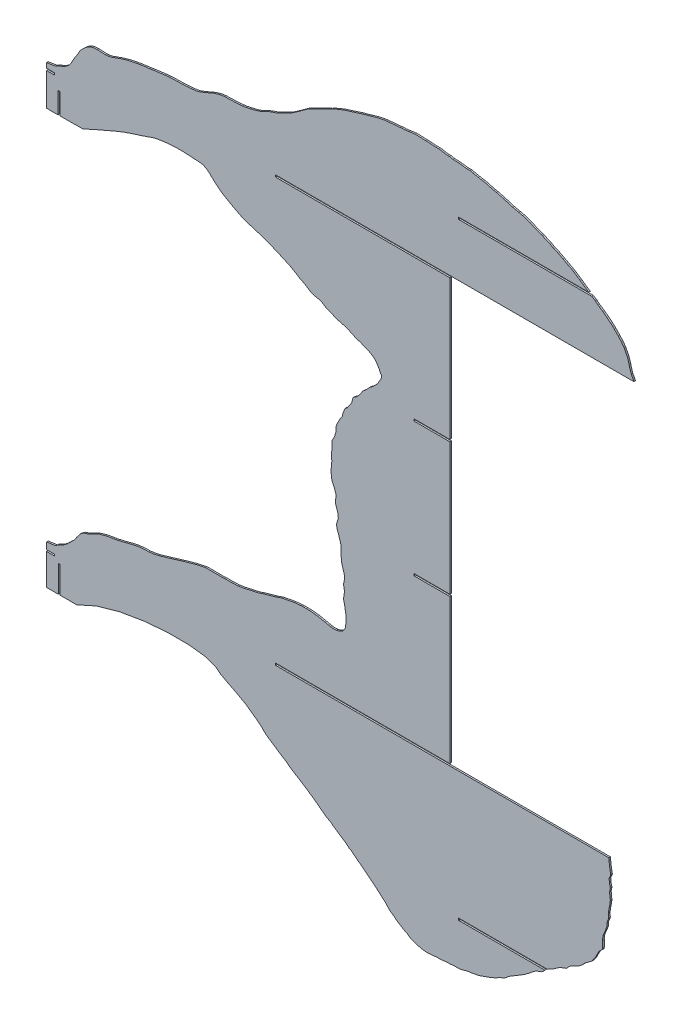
from build123d import *

# Parameters (mm, degrees)
EXTRUDE_1_DEPTH = 2


with BuildPart() as part:
    # Model → Extrude 1 (new body)
    with BuildSketch(Plane.XY):
        Polygon((-3659.4088, 337.2623), (-3649.3155, 337.2623), (-3649.3155, 339.2623), (-3659.4088, 339.2623), (-3659.4088, 347.0727), (-3659.15, 347.5463), (-3647.8631, 349.1225), (-3646.4682, 350.2928), (-3646.1801, 350.5755), (-3644.035, 351.8111), (-3640.8509, 353.3027), (-3638.1073, 355.0172), (-3637.5726, 355.2726), (-3637.2801, 355.5406), (-3635.3742, 356.9104), (-3635.3505, 356.9504), (-3632.9974, 358.7257), (-3631.9578, 360.0561), (-3630.5631, 361.0845), (-3629.7103, 361.911), (-3629.6644, 362.1925), (-3625.4574, 366.0569), (-3625.409, 366.1805), (-3622.3043, 370.4676), (-3621.7645, 371.2607), (-3621.5765, 371.5394), (-3621.3887, 371.8182), (-3621.0192, 372.2063), (-3617.6821, 376.6565), (-3615.281, 378.6078), (-3613.1208, 380.0967), (-3608.8328, 381.5595), (-3604.8656, 383.1913), (-3602.0015, 384.5371), (-3597.7094, 386.8426), (-3595.8936, 387.7443), (-3592.8574, 389.0094), (-3585.2364, 391.0565), (-3585.1795, 391.0721), (-3585.1226, 391.0877), (-3584.9168, 391.1142), (-3577.4862, 392.5355), (-3575.5445, 392.7956), (-3573.322, 393.1171), (-3570.3986, 393.6991), (-3568.5413, 394.2156), (-3561.6069, 395.7715), (-3560.2819, 396.0994), (-3559.4776, 396.3291), (-3551.2263, 398.491), (-3550.5538, 398.6438), (-3547.3795, 399.2746), (-3546.0565, 399.5196), (-3543.9064, 399.7692), (-3539.775, 400.2472), (-3531.8396, 400.5535), (-3527.8975, 400.968), (-3525.4073, 401.3409), (-3520.2647, 402.5635), (-3518.7104, 402.8664), (-3517.6553, 403.1274), (-3511.9556, 404.8469), (-3506.9614, 406.2412), (-3498.2225, 408.9567), (-3496.8997, 409.4214), (-3491.8927, 410.8884), (-3491.0672, 411.0675), (-3488.8385, 411.8241), (-3483.442, 413.3824), (-3478.422, 414.7273), (-3472.647, 416.3851), (-3471.3883, 416.6549), (-3461.5572, 418.7129), (-3461.0606, 418.8202), (-3460.6243, 418.8555), (-3452.8575, 418.8324), (-3445.1597, 418.7839), (-3441.9923, 418.7149), (-3439.0233, 418.7909), (-3437.056, 418.9925), (-3431.6905, 418.9816), (-3429.2882, 418.8589), (-3427.9578, 418.9259), (-3424.1756, 419.1709), (-3421.4486, 419.2988), (-3420.5516, 419.3881), (-3419.4176, 419.5984), (-3413.984, 420.3053), (-3408.2791, 421.6846), (-3408.253, 421.69), (-3408.2269, 421.6954), (-3408.1771, 421.7132), (-3408.13, 421.7249), (-3403.4, 422.847), (-3401.0462, 423.1767), (-3398.1966, 423.8763), (-3394.6744, 424.7099), (-3390.1671, 426.2731), (-3389.9757, 426.3233), (-3389.7843, 426.3735), (-3389.6265, 426.4156), (-3389.4688, 426.4576), (-3382.1798, 428.6192), (-3380.5787, 429.0409), (-3374.8822, 430.6557), (-3371.9735, 431.5056), (-3369.5433, 432.4494), (-3366.4566, 433.4155), (-3364.357, 433.9945), (-3360.9254, 434.5253), (-3352.9075, 436.1205), (-3350.255, 436.5114), (-3344.5418, 437.0877), (-3341.8287, 437.3396), (-3340.596, 437.3971), (-3335.0216, 437.4364), (-3330.9464, 437.28), (-3326.0731, 436.8271), (-3321.4552, 436.3248), (-3312.8116, 434.5679), (-3308.004, 433.5045), (-3305.5709, 432.9001), (-3304.4671, 432.9049), (-3302.5904, 432.6146), (-3298.4105, 432.7226), (-3298.3045, 432.7126), (-3298.1986, 432.7124), (-3295.7388, 433.4062), (-3295.0428, 433.5812), (-3293.192, 434.3278), (-3290.2706, 436.0132), (-3290.0604, 436.2078), (-3289.981, 436.3371), (-3289.9019, 436.4664), (-3288.0821, 438.7803), (-3287.0845, 440.5862), (-3286.7364, 442.4386), (-3286.4866, 445.0603), (-3286.3692, 445.7683), (-3286.2518, 446.4763), (-3286.1373, 446.9131), (-3286.1268, 447.0846), (-3286.1165, 447.2561), (-3286.0177, 448.2623), (-3285.8695, 449.9895), (-3285.8734, 450.7023), (-3285.8775, 451.415), (-3286.4085, 456.209), (-3286.5682, 457.0887), (-3286.7279, 457.9685), (-3287.5396, 463.1307), (-3287.6644, 463.8354), (-3289.1263, 470.3016), (-3289.1683, 471.0357), (-3289.2103, 471.7697), (-3289.211, 471.8312), (-3289.1859, 471.8983), (-3289.1607, 471.9655), (-3288.2274, 478.2117), (-3288.3211, 481.2084), (-3289.1314, 486.151), (-3289.0694, 486.6238), (-3289.0074, 487.0965), (-3288.9803, 488.2449), (-3288.9534, 489.3932), (-3288.377, 490.986), (-3288.2838, 491.6988), (-3288.2847, 492.9639), (-3287.9085, 495.7334), (-3288.4552, 498.5319), (-3289.7574, 502.7495), (-3290.0123, 503.6582), (-3290.2672, 504.567), (-3290.6309, 505.4973), (-3290.9947, 506.4277), (-3291.5194, 509.0262), (-3291.9017, 512.7728), (-3292.0426, 513.9631), (-3292.1837, 515.1535), (-3292.3988, 521.6939), (-3292.3992, 525.126), (-3292.7205, 528.4976), (-3292.868, 529.2128), (-3293.0155, 529.928), (-3293.8077, 532.2159), (-3294.9315, 535.9393), (-3295.3668, 537.6521), (-3297.4005, 542.8596), (-3297.8387, 545.6981), (-3297.9193, 546.8756), (-3297.2691, 550.3362), (-3296.1248, 553.7305), (-3295.9139, 554.3348), (-3295.703, 554.9392), (-3296.2838, 559.1301), (-3296.2635, 560.0077), (-3296.293, 560.2726), (-3299.1519, 568.9351), (-3299.2755, 569.3047), (-3299.2767, 569.3159), (-3299.2782, 569.3272), (-3299.2747, 569.3801), (-3299.2713, 569.433), (-3299.1732, 574.0535), (-3299.0118, 574.3897), (-3298.8504, 574.7258), (-3298.4647, 578.0221), (-3298.4412, 578.593), (-3299.8748, 582.7346), (-3299.9605, 583.1378), (-3300.0465, 583.541), (-3303.6085, 591.5479), (-3303.8116, 592.3677), (-3304.015, 593.1875), (-3304.2962, 594.9847), (-3304.7821, 601.4762), (-3304.6607, 603.6652), (-3304.1312, 608.1517), (-3303.8829, 612.1683), (-3303.9595, 614.127), (-3304.1243, 616.8857), (-3303.9539, 618.0922), (-3303.9539, 618.4237), (-3303.9539, 618.7551), (-3303.9288, 623.5233), (-3303.4842, 626.4954), (-3303.9464, 630.7457), (-3303.8768, 631.8074), (-3303.868, 632.5643), (-3303.8592, 633.3213), (-3303.5899, 634.428), (-3303.3209, 635.5347), (-3301.1346, 639.1162), (-3300.7923, 639.759), (-3300.4503, 640.4017), (-3300.1502, 641.4346), (-3299.8658, 642.6189), (-3298.7037, 646.5537), (-3298.8087, 648.1917), (-3298.7528, 651.0909), (-3298.1815, 654.047), (-3297.7955, 654.6354), (-3297.4095, 655.2239), (-3297.0513, 656.4668), (-3295.2716, 659.7721), (-3294.9403, 660.5859), (-3293.9227, 662.4513), (-3293.449, 663.5491), (-3291.3519, 666.3707), (-3290.6597, 667.2816), (-3290.566, 667.9143), (-3290.0118, 671.2581), (-3288.2508, 675.3898), (-3287.9769, 676.1389), (-3287.703, 676.8879), (-3287.596, 677.1597), (-3287.4891, 677.4314), (-3285.8311, 678.5922), (-3284.6109, 679.4458), (-3283.7684, 680.897), (-3282.9823, 682.2129), (-3282.0411, 683.3925), (-3280.0972, 686.2822), (-3279.3026, 687.7454), (-3278.6788, 689.0056), (-3278.2823, 691.4264), (-3278.0636, 692.3671), (-3277.2506, 694.4464), (-3276.8765, 694.7518), (-3276.5028, 695.0573), (-3273.807, 696.7064), (-3272.2908, 698.0122), (-3269.5076, 701.1151), (-3269.168, 701.4777), (-3268.8287, 701.8403), (-3267.7982, 703.2976), (-3265.567, 706.9701), (-3264.3548, 708.0449), (-3261.1759, 710.6555), (-3258.0545, 714.1406), (-3257.8165, 714.4504), (-3257.5787, 714.7603), (-3257.3382, 714.9592), (-3257.098, 715.1581), (-3256.7957, 715.4345), (-3256.4937, 715.7108), (-3252.5233, 718.6021), (-3248.8912, 722.4143), (-3247.3201, 723.8026), (-3245.9958, 725.8405), (-3245.2092, 727.6705), (-3243.5615, 730.1585), (-3243.134, 730.8071), (-3242.7065, 731.4558), (-3242.0099, 733.3641), (-3241.9269, 733.6895), (-3241.8515, 734.2061), (-3241.7763, 734.7227), (-3241.8591, 734.9879), (-3241.9206, 735.3684), (-3241.8547, 735.8762), (-3242.0375, 736.2616), (-3242.5737, 736.7289), (-3244.0129, 738.9802), (-3244.1408, 739.5122), (-3244.269, 740.0442), (-3244.6142, 740.8704), (-3244.9594, 741.6967), (-3245.9213, 743.0676), (-3245.9438, 743.2604), (-3245.9662, 743.4531), (-3247.2288, 745.085), (-3247.4561, 745.5867), (-3247.6837, 746.0885), (-3249.544, 748.7163), (-3253.4732, 751.6041), (-3253.4757, 751.606), (-3253.4835, 751.6101), (-3257.6417, 754.1653), (-3262.1629, 755.7285), (-3262.3995, 755.7892), (-3262.6361, 755.8499), (-3263.9842, 756.4589), (-3265.1583, 757.1176), (-3265.3277, 757.1771), (-3265.4971, 757.2367), (-3267.7598, 758.3345), (-3267.8023, 758.3399), (-3267.8448, 758.3452), (-3267.9554, 758.3641), (-3268.0662, 758.3831), (-3270.1812, 759.0607), (-3273.4439, 759.9802), (-3273.6295, 760.0104), (-3278.2227, 762.4507), (-3280.8057, 763.4719), (-3281.1295, 763.6698), (-3281.3311, 763.739), (-3281.4625, 763.7821), (-3281.5938, 763.8252), (-3283.2899, 764.5444), (-3286.849, 766.1364), (-3287.5362, 766.2044), (-3288.2559, 766.3848), (-3291.9708, 767.3807), (-3295.4251, 768.2042), (-3296.5272, 768.5413), (-3300.2991, 769.955), (-3302.3817, 770.8872), (-3305.3765, 772.4581), (-3310.0709, 773.8463), (-3310.1431, 773.8709), (-3314.9315, 777.0049), (-3315.1859, 777.1483), (-3315.4403, 777.2916), (-3317.6864, 778.3079), (-3320.7918, 779.2971), (-3320.8267, 779.312), (-3320.8619, 779.3269), (-3320.8863, 779.3302), (-3320.9107, 779.3335), (-3324.909, 780.0305), (-3325.6712, 780.1598), (-3328.4002, 780.927), (-3329.2103, 781.4102), (-3331.5672, 782.679), (-3334.608, 784.7333), (-3336.3646, 785.9934), (-3338.3443, 787.0547), (-3344.4989, 790.1213), (-3348.366, 792.7183), (-3352.0919, 794.8547), (-3357.2703, 797.7913), (-3363.6226, 800.3911), (-3363.7108, 800.4222), (-3370.304, 803.5359), (-3370.6639, 803.6913), (-3370.9935, 803.8199), (-3371.3231, 803.9485), (-3381.347, 808.0862), (-3383.9945, 809.0479), (-3390.9222, 811.6316), (-3398.2713, 813.9082), (-3407.9417, 816.9002), (-3414.3045, 819.1515), (-3415.0643, 819.4529), (-3415.512, 819.652), (-3416.5509, 820.1542), (-3423.0863, 823.4036), (-3429.8287, 827.0191), (-3434.5516, 829.7068), (-3438.0753, 831.8914), (-3443.1605, 835.229), (-3443.8228, 835.7111), (-3448.0802, 839.1972), (-3454.4495, 845.062), (-3457.4896, 847.9663), (-3460.776, 850.2266), (-3461.0572, 850.4297), (-3461.1978, 850.4887), (-3461.3385, 850.5477), (-3462.8902, 851.1951), (-3464.6693, 851.9994), (-3464.7684, 852.0405), (-3464.8678, 852.0816), (-3466.9093, 852.3552), (-3468.0477, 852.5371), (-3468.1446, 852.5561), (-3468.2418, 852.5751), (-3469.6773, 852.6567), (-3489.7198, 853.8401), (-3492.774, 853.7993), (-3497.9481, 853.8388), (-3500.9335, 853.6661), (-3505.2528, 853.3816), (-3513.0054, 852.5294), (-3514.4254, 852.4082), (-3516.0228, 852.1261), (-3521.453, 851.2953), (-3525.514, 850.2896), (-3528.2471, 849.4955), (-3533.7718, 847.5649), (-3541.2449, 845.0394), (-3552.2575, 841.4723), (-3553.265, 841.1592), (-3554.1062, 840.8693), (-3562.8416, 837.9146), (-3564.9625, 837.0508), (-3574.9366, 833.1111), (-3585.1458, 828.5784), (-3585.6634, 828.3682), (-3586.254, 828.1343), (-3599.0191, 822.6442), (-3601.8382, 821.5305), (-3608.5824, 818.2112), (-3610.5816, 817.349), (-3614.3665, 815.8294), (-3642.4041, 815.5363), (-3642.4041, 841.861), (-3642.6541, 841.861), (-3644.6541, 841.861), (-3644.9041, 841.861), (-3644.9041, 815.5121), (-3659.3858, 815.4688), (-3659.3858, 856.2086), (-3649.316, 856.2086), (-3649.316, 856.4586), (-3649.316, 858.4586), (-3649.316, 858.7086), (-3659.3858, 858.7086), (-3659.3858, 864.7969), (-3647.9893, 866.4534), (-3647.8953, 866.593), (-3647.6441, 866.8042), (-3645.7834, 868.0435), (-3644.0457, 868.8997), (-3640.8592, 870.0783), (-3638.7601, 870.9019), (-3636.629, 872.0472), (-3634.2489, 873.5946), (-3631.9635, 875.3132), (-3631.1352, 876.1233), (-3629.5645, 878.2477), (-3628.9544, 878.8694), (-3626.8436, 883.0201), (-3624.7706, 886.6925), (-3621.5199, 891.5044), (-3620.9991, 892.5305), (-3617.6552, 898.2273), (-3616.7344, 899.4209), (-3614.7832, 901.4733), (-3611.5046, 904.5562), (-3608.7801, 906.7772), (-3607.237, 907.6827), (-3605.7431, 908.3713), (-3604.0188, 909.3092), (-3601.7493, 909.9563), (-3600.7467, 910.1682), (-3596.7349, 910.4182), (-3596.1116, 910.4482), (-3594.8358, 910.4113), (-3586.4615, 909.9118), (-3584.7601, 910.0518), (-3583.7032, 910.0595), (-3581.951, 910.3115), (-3578.7935, 910.9379), (-3575.3807, 912.1852), (-3572.1094, 913.3336), (-3565.0184, 915.7952), (-3558.1956, 917.7784), (-3555.8431, 918.3431), (-3548.345, 919.8879), (-3545.3575, 920.4164), (-3542.3709, 920.8733), (-3534.6871, 922.0118), (-3530.795, 922.4594), (-3526.5269, 923.1776), (-3512.223, 925.0082), (-3511.2288, 925.1937), (-3508.8919, 925.4513), (-3507.5035, 925.5681), (-3506.0799, 925.6306), (-3496.6702, 926.0156), (-3489.9332, 926.0608), (-3483.2576, 926.4611), (-3479.4324, 926.6715), (-3478.7796, 926.7676), (-3470.3089, 927.9437), (-3462.6541, 930.9243), (-3460.3426, 931.8104), (-3458.4007, 932.6805), (-3450.8297, 935.9166), (-3446.2745, 937.3384), (-3442.9949, 938.2039), (-3439.15, 938.7933), (-3436.6998, 939.0336), (-3424.8426, 939.4286), (-3421.5628, 939.4724), (-3418.7498, 939.7201), (-3415.4578, 940.0453), (-3414.2074, 940.3191), (-3411.1317, 940.6419), (-3409.4183, 941.1027), (-3405.9991, 941.702), (-3404.055, 942.2954), (-3401.0689, 942.9113), (-3397.1671, 943.9469), (-3394.4056, 944.8274), (-3393.0582, 945.3064), (-3390.7615, 946.2192), (-3385.4364, 949.0115), (-3383.3939, 950.0313), (-3379.6944, 951.3529), (-3375.3841, 952.932), (-3372.5213, 953.7422), (-3370.5145, 954.6492), (-3367.0245, 956.4463), (-3364.1844, 958.1299), (-3355.1561, 962.6889), (-3353.139, 963.6598), (-3352.1844, 964.2932), (-3343.7652, 970.105), (-3341.6449, 971.738), (-3334.7989, 976.7271), (-3334.5391, 976.8698), (-3334.2796, 977.0125), (-3328.3748, 980.0772), (-3327.4505, 980.5332), (-3323.515, 982.5596), (-3318.4722, 985.2311), (-3312.949, 987.8814), (-3305.0194, 991.6101), (-3302.326, 993.0651), (-3299.047, 994.6173), (-3295.616, 996.1498), (-3289.6229, 998.4661), (-3286.3619, 999.6426), (-3280.9024, 1001.2554), (-3266.3443, 1005.9871), (-3265.1715, 1006.3008), (-3262.743, 1006.8989), (-3254.418, 1009.2996), (-3246.4511, 1011.6083), (-3239.1218, 1013.0641), (-3235.5695, 1013.637), (-3233.4084, 1013.7434), (-3226.0168, 1014.4719), (-3222.0986, 1014.5996), (-3218.6115, 1015.0579), (-3217.0922, 1015.3057), (-3212.8058, 1015.464), (-3208.892, 1015.8962), (-3207.0861, 1016.2246), (-3199.965, 1017.2197), (-3199.7851, 1017.2374), (-3187.143, 1016.7146), (-3187.039, 1016.7155), (-3186.8722, 1016.7124), (-3186.6366, 1016.721), (-3186.4977, 1016.7236), (-3186.1857, 1016.7395), (-3181.6213, 1016.6107), (-3176.5253, 1016.1841), (-3174.4755, 1016.0643), (-3170.4511, 1015.9727), (-3167.4169, 1015.7316), (-3164.1752, 1015.0105), (-3159.4797, 1014.3843), (-3157.2184, 1014.4535), (-3153.0842, 1013.5867), (-3152.4308, 1013.4922), (-3152.007, 1013.4844), (-3146.0573, 1013.3621), (-3143.1623, 1012.9193), (-3135.2804, 1012.0338), (-3131.7272, 1012.0886), (-3130.4721, 1011.8825), (-3128.1699, 1011.2957), (-3121.5251, 1009.9906), (-3116.5737, 1009.0452), (-3114.7575, 1008.8447), (-3110.3439, 1007.8218), (-3105.7905, 1006.4678), (-3103.6911, 1005.9749), (-3101.7072, 1005.438), (-3099.2241, 1005.0532), (-3097.79, 1004.7625), (-3090.5932, 1002.7439), (-3089.8595, 1002.4749), (-3087.7223, 1001.8516), (-3084.2983, 1000.9777), (-3079.1979, 999.2354), (-3079.0932, 999.2075), (-3078.9887, 999.1796), (-3072.1176, 997.6453), (-3071.2631, 997.4701), (-3070.4152, 997.33), (-3065.9118, 996.1691), (-3062.2502, 994.9215), (-3056.8659, 993.0621), (-3050.217, 990.2177), (-3043.081, 987.3744), (-3042.2514, 987.0974), (-3042.1471, 987.0596), (-3042.0431, 987.0219), (-3041.0881, 986.6451), (-3040.7568, 986.4705), (-3032.4577, 983.0962), (-3028.5424, 980.6213), (-3028.1083, 980.4074), (-3027.0556, 979.918), (-3021.9523, 977.8827), (-3020.6923, 977.3246), (-3015.8303, 974.6774), (-3011.3066, 972.1929), (-3008.923, 970.9335), (-3004.2665, 968.5678), (-3001.83, 967.1127), (-2997.6825, 964.2315), (-2994.9662, 962.5305), (-2993.8488, 961.7048), (-2990.8005, 959.5125), (-2987.5549, 957.272), (-2983.6554, 954.7347), (-3145.8259, 954.7347), (-3145.8259, 954.4847), (-3145.8259, 952.4847), (-3145.8259, 952.2347), (-2979.8132, 952.2347), (-2976.1357, 949.8417), (-2975.9135, 949.839), (-2975.1437, 949.1253), (-2972.0876, 946.6941), (-2970.3879, 945.4772), (-2965.9321, 942.5773), (-2961.0138, 938.7025), (-2956.2192, 934.9081), (-2953.7184, 932.684), (-2951.7961, 930.8381), (-2947.082, 925.9453), (-2943.0876, 921.5538), (-2939.9638, 917.2482), (-2939.7726, 916.9605), (-2939.5815, 916.6729), (-2939.5114, 916.578), (-2939.4413, 916.4832), (-2939.3244, 916.2833), (-2935.5815, 908.8784), (-2933.443, 902.1873), (-2932.9658, 899.6112), (-2930.7573, 892.8222), (-2930.7099, 892.6954), (-2930.6628, 892.5687), (-2930.5705, 892.3879), (-2930.4296, 892.1415), (-2928.8803, 889.5667), (-2927.4014, 886.3446), (-3373.7833, 886.3446), (-3373.7833, 886.0946), (-3373.7833, 884.0946), (-3373.7833, 883.8446), (-3156.8957, 883.8446), (-3156.8959, 709.7752), (-3156.8958, 709.3446), (-3201.3417, 709.3446), (-3201.3417, 709.0946), (-3201.3417, 707.0946), (-3201.3417, 706.8446), (-3156.8957, 706.8446), (-3156.8959, 542.3446), (-3201.3417, 542.3446), (-3201.3417, 542.0946), (-3201.3417, 540.0946), (-3201.3417, 539.8446), (-3156.8959, 539.8446), (-3156.8959, 359.5244), (-3373.7833, 359.5244), (-3373.7833, 359.2744), (-3373.7833, 357.2744), (-3373.7833, 357.0244), (-2958.6672, 357.0244), (-2958.3149, 354.7516), (-2958.3232, 353.9806), (-2958.3317, 353.2096), (-2957.8796, 349.3527), (-2957.2075, 344.7798), (-2956.3559, 340.6346), (-2956.3134, 339.323), (-2956.8327, 337.8619), (-2958.2021, 335.3839), (-2958.3251, 335.1666), (-2958.0527, 331.6184), (-2958.0966, 330.7587), (-2957.2011, 327.017), (-2956.7939, 325.1415), (-2957.7475, 320.8556), (-2957.7663, 320.7497), (-2957.766, 320.7263), (-2957.7658, 320.7029), (-2957.7575, 320.5815), (-2957.235, 314.8627), (-2956.7741, 311.8534), (-2956.8757, 311.2131), (-2956.9772, 310.5728), (-2957.2477, 308.1546), (-2957.3705, 307.3997), (-2957.4933, 306.6448), (-2958.0566, 304.2709), (-2959.089, 298.084), (-2959.1899, 297.6251), (-2959.2907, 297.1662), (-2959.2643, 296.9473), (-2959.2382, 296.7283), (-2958.7841, 291.6689), (-2959.4282, 289.9817), (-2960.8744, 286.2074), (-2960.9382, 285.1833), (-2960.9501, 282.7106), (-2961.2389, 281.0414), (-2962.1281, 278.7824), (-2962.426, 277.6918), (-2965.9311, 269.3624), (-2965.9699, 269.2189), (-2966.0087, 269.0754), (-2966.3993, 265.3298), (-2966.3383, 264.4336), (-2966.2773, 263.5375), (-2966.3241, 255.2684), (-2966.8386, 253.808), (-2970.4057, 250.3617), (-2970.4919, 250.2846), (-2970.5783, 250.2074), (-2970.601, 250.182), (-2970.6237, 250.1566), (-2970.6948, 250.0223), (-2970.7658, 249.888), (-2974.2057, 243.9018), (-2974.6855, 242.3192), (-2976.3425, 239.655), (-2978.4638, 236.8708), (-2979.9206, 234.7725), (-2981.4711, 233.7217), (-2983.7516, 231.9291), (-2986.4101, 229.984), (-2988.1603, 228.8165), (-2988.528, 228.4632), (-2988.8957, 228.11), (-2990.3691, 226.5146), (-2991.6098, 225.0934), (-2994.446, 222.8578), (-2996.5976, 221.1639), (-2997.0395, 220.7253), (-2999.3176, 219.9158), (-3004.6015, 217.4568), (-3007.2321, 215.5611), (-3011.2524, 211.6567), (-3011.6664, 211.2264), (-3011.9528, 211.0301), (-3019.0969, 208.3746), (-3019.5236, 208.1617), (-3024.0229, 205.2026), (-3024.6364, 204.6753), (-3027.1142, 202.9809), (-3029.499, 201.5819), (-3032.4228, 200.0281), (-3035.2356, 198.3447), (-3145.8261, 198.3447), (-3145.8261, 198.0947), (-3145.8261, 196.0947), (-3145.8261, 195.8447), (-3038.5301, 195.8447), (-3041.1181, 192.95), (-3041.5658, 192.6087), (-3042.0136, 192.2674), (-3042.1032, 192.2212), (-3042.1928, 192.175), (-3044.2822, 191.4335), (-3048.0651, 189.9975), (-3049.9594, 189.0178), (-3052.4206, 187.4818), (-3054.8742, 185.3341), (-3056.5998, 183.7789), (-3058.1137, 182.6903), (-3060.8849, 180.8351), (-3063.3803, 178.7208), (-3064.8454, 177.7931), (-3067.7927, 176.1211), (-3071.5624, 173.7137), (-3077.5864, 170.1723), (-3080.8954, 168.2455), (-3083.487, 166.449), (-3087.1896, 163.3555), (-3087.5861, 162.9876), (-3087.9828, 162.6197), (-3088.1601, 162.5464), (-3088.3373, 162.473), (-3091.4282, 161.0721), (-3094.0383, 160.0685), (-3095.9494, 158.9376), (-3097.1681, 158.3371), (-3099.6332, 156.7804), (-3103.7294, 155.2673), (-3107.6774, 153.5552), (-3109.4384, 152.8182), (-3110.7629, 152.4226), (-3117.298, 150.0834), (-3120.7189, 148.8921), (-3125.4994, 148.0242), (-3128.6576, 147.3734), (-3131.2966, 147.0653), (-3133.027, 146.8652), (-3140.0209, 145.2447), (-3142.7231, 144.3251), (-3144.2272, 144.108), (-3150.9745, 144.0677), (-3156.9399, 143.4772), (-3159.4491, 143.4407), (-3162.1259, 143.271), (-3167.7248, 142.5842), (-3174.1257, 142.4988), (-3174.4596, 142.4713), (-3174.7158, 142.3904), (-3175.0368, 142.3), (-3184.1176, 141.5075), (-3187.883, 141.6083), (-3193.3476, 142.5215), (-3196.8686, 143.3399), (-3203.1962, 145.5317), (-3206.415, 147.0634), (-3209.9216, 149.4748), (-3212.9496, 150.9877), (-3213.6818, 151.3967), (-3215.9716, 152.763), (-3223.4201, 157.5083), (-3225.0756, 158.9967), (-3230.1425, 162.6088), (-3231.5409, 163.6431), (-3235.8554, 167.9881), (-3237.1276, 169.6181), (-3242.8871, 174.6498), (-3243.8117, 175.5679), (-3244.3735, 176.0997), (-3250.3414, 181.0518), (-3252.0372, 182.4574), (-3252.305, 182.6534), (-3252.5728, 182.8494), (-3260.2808, 188.9642), (-3266.1009, 193.6899), (-3266.6981, 194.224), (-3270.3953, 196.9502), (-3275.6785, 200.9712), (-3278.2064, 203.0103), (-3279.6695, 204.218), (-3281.8336, 205.2836), (-3284.9657, 207.9763), (-3286.5553, 209.2875), (-3290.7105, 211.9827), (-3298.0733, 216.9114), (-3303.1182, 220.3036), (-3304.4283, 221.7002), (-3306.9268, 223.0696), (-3309.7877, 224.5658), (-3311.9417, 225.8276), (-3313.473, 227.3884), (-3316.0694, 229.0747), (-3318.2752, 230.9593), (-3322.3177, 233.9311), (-3325.0667, 235.9498), (-3325.9027, 236.5748), (-3335.1617, 242.8298), (-3335.7308, 243.209), (-3336.0811, 243.4555), (-3342.9874, 248.0612), (-3348.9176, 251.448), (-3356.3167, 256.2926), (-3360.9947, 260.0541), (-3364.0924, 261.7926), (-3370.2945, 265.9522), (-3371.6387, 266.8392), (-3372.6663, 267.5587), (-3385.2786, 275.9761), (-3389.4361, 279.7353), (-3390.6385, 281.1689), (-3394.9207, 284.7967), (-3399.4915, 288.3003), (-3409.5186, 295.4055), (-3410.7393, 296.2526), (-3411.0123, 296.437), (-3411.619, 296.8125), (-3420.5633, 301.8272), (-3425.4034, 304.3666), (-3435.0133, 309.1765), (-3439.2406, 311.5276), (-3442.2027, 313.1296), (-3445.9664, 315.9988), (-3447.3262, 317.134), (-3448.5252, 318.1531), (-3461.0296, 322.7054), (-3481.6055, 325.1432), (-3507.8587, 325.2612), (-3537.3946, 322.8536), (-3567.8188, 317.715), (-3596.7369, 309.6396), (-3621.7545, 298.4222), (-3642.6541, 298.4013), (-3642.6541, 331.8357), (-3644.6541, 331.8357), (-3644.6541, 298.3993), (-3659.4088, 298.3951), align=None)
    extrude(amount=EXTRUDE_1_DEPTH)


solid = part.part
